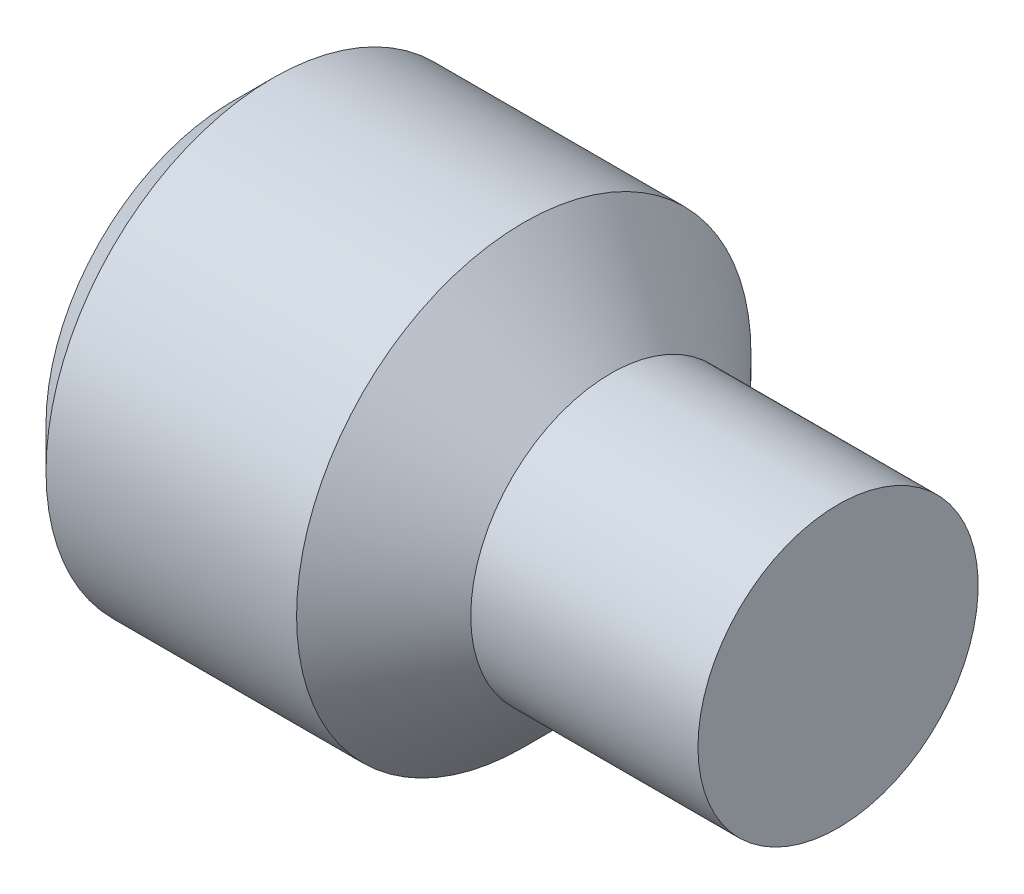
from build123d import *

# Parameters (mm, degrees)
HEXAGONSOCKET_DEPTH = 2


with BuildPart() as part:
    # Sketch1 → Base (revolve)
    with BuildSketch(Plane.XY, mode=Mode.PRIVATE) as base_sk:
        Polygon((0, 0), (8, 0), (8, 1.85), (5, 1.85), (3.85, 3), (0.5415, 3), (0, 2.4585), align=None)
    revolve(base_sk.sketch.rotate(Axis((-1.968820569, 0, 0), (1, 0, 0)), 90), axis=Axis((-1.968820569, 0, 0), (1, 0, 0)))

    # Sketch2 → HexagonSocket (cut)
    with BuildSketch(Plane(origin=(0, -1.128463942, -0.35035393), x_dir=(0, 0, 1), z_dir=(-1, 0, 0))):
        Polygon((2.093951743, 1.128463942), (1.222152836, 2.638463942), (-0.521444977, 2.638463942), (-1.393243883, 1.128463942), (-0.521444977, -0.381536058), (1.222152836, -0.381536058), align=None)
    extrude(amount=-HEXAGONSOCKET_DEPTH, mode=Mode.SUBTRACT)

    # Sketch3 → Cut-Revolve1 (revolve, cut)
    with BuildSketch(Plane.XY, mode=Mode.PRIVATE) as cut_revolve1_sk:
        Polygon((2, 1.51), (2, 0), (2.4, 0), align=None)
    revolve(cut_revolve1_sk.sketch.rotate(Axis((-0.330994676, 0, 0), (1, 0, 0)), 90), axis=Axis((-0.330994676, 0, 0), (1, 0, 0)), mode=Mode.SUBTRACT)


solid = part.part
